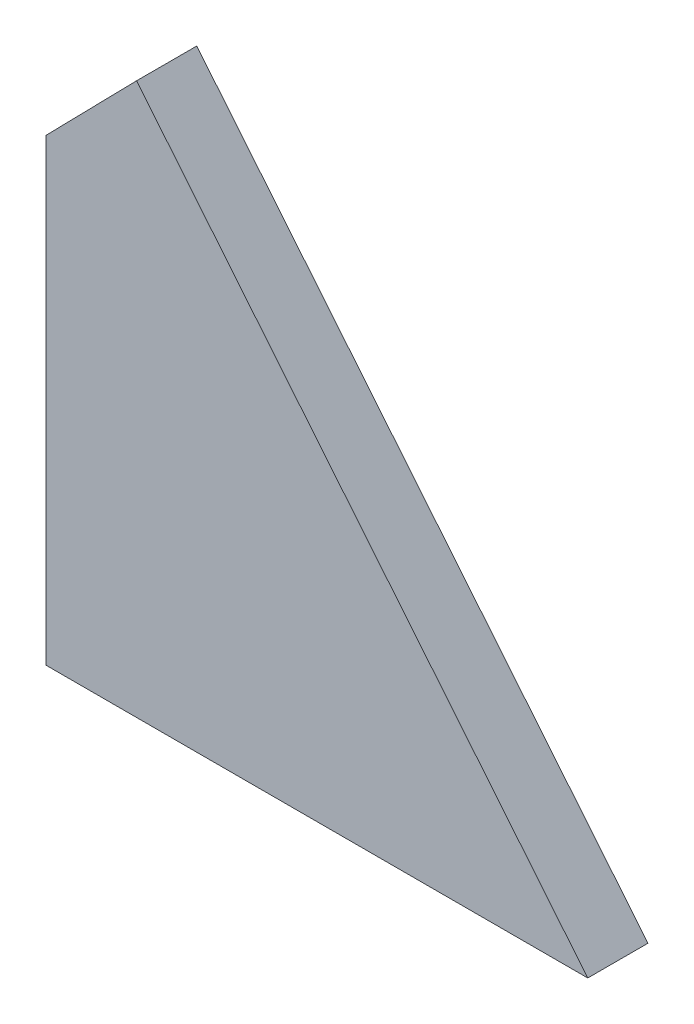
from build123d import *

# Parameters (mm, degrees)
EXTRUSION1_DEPTH        = 8
ENL_V_MAT_EXTRU_1_DEPTH = 8


with BuildPart() as part:
    # Esquisse1 → Extrusion1 (new body)
    with BuildSketch(Plane.XY):
        Polygon((0, 0), (0, 88), (72, 0), align=None)
    extrude(amount=EXTRUSION1_DEPTH)

    # Esquisse2 → Enl_v. mat.-Extru.1 (cut)
    with BuildSketch(Plane.XY.offset(8)):
        Polygon((0, 88), (0, 61), (12.031518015, 73.294811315), align=None)
    extrude(amount=-ENL_V_MAT_EXTRU_1_DEPTH, mode=Mode.SUBTRACT)


solid = part.part
